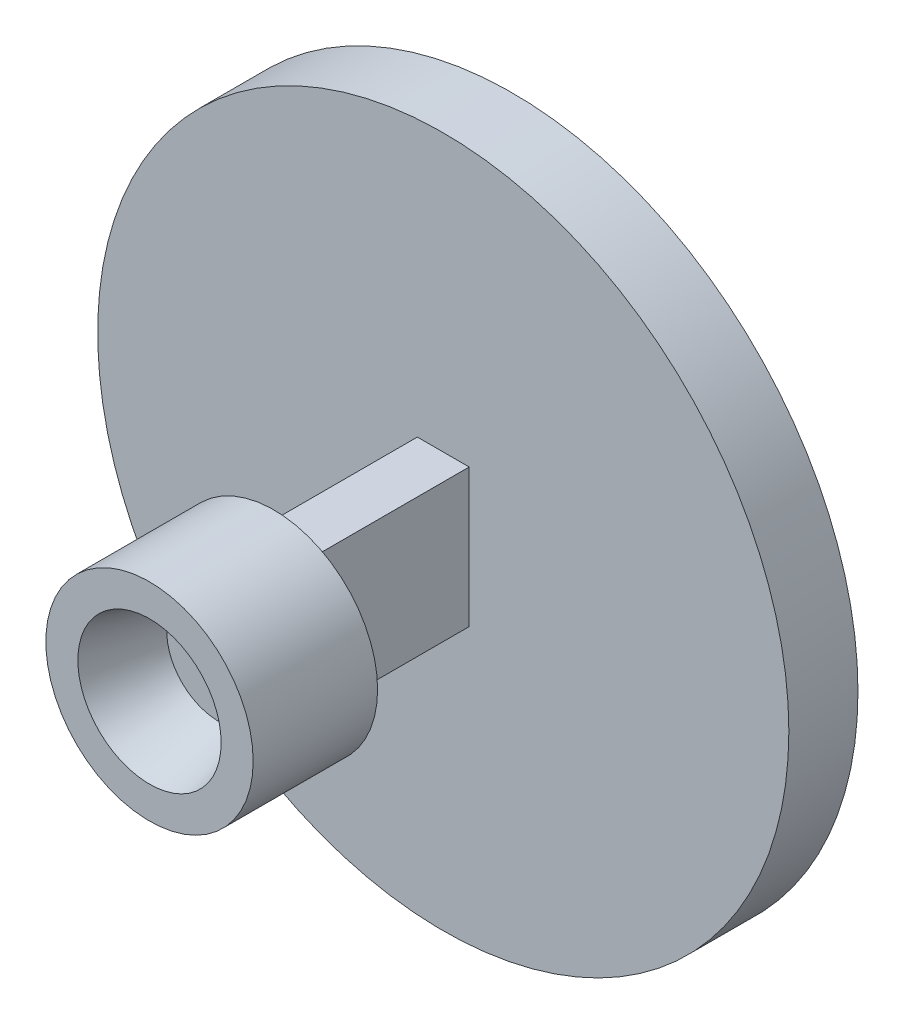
ISO-10303-21;
HEADER;
FILE_DESCRIPTION(('STEP AP214'),'2;1');
FILE_NAME('part.step','',(''),(''),'','','');
FILE_SCHEMA(('AUTOMOTIVE_DESIGN { 1 0 10303 214 1 1 1 1 }'));
ENDSEC;
DATA;
#1=APPLICATION_CONTEXT('core data for automotive mechanical design processes');
#2=APPLICATION_PROTOCOL_DEFINITION('international standard','automotive_design',2000,#1);
#3=PRODUCT_CONTEXT('',#1,'mechanical');
#4=PRODUCT('Part','Part','',(#3));
#5=PRODUCT_RELATED_PRODUCT_CATEGORY('part','',(#4));
#6=PRODUCT_DEFINITION_FORMATION('','',#4);
#7=PRODUCT_DEFINITION_CONTEXT('part definition',#1,'design');
#8=PRODUCT_DEFINITION('design','',#6,#7);
#9=PRODUCT_DEFINITION_SHAPE('','',#8);
#10=(LENGTH_UNIT() NAMED_UNIT(*) SI_UNIT(.MILLI.,.METRE.));
#11=(NAMED_UNIT(*) PLANE_ANGLE_UNIT() SI_UNIT($,.RADIAN.));
#12=(NAMED_UNIT(*) SI_UNIT($,.STERADIAN.) SOLID_ANGLE_UNIT());
#13=UNCERTAINTY_MEASURE_WITH_UNIT(LENGTH_MEASURE(1.E-05),#10,'distance_accuracy_value','');
#14=(GEOMETRIC_REPRESENTATION_CONTEXT(3) GLOBAL_UNCERTAINTY_ASSIGNED_CONTEXT((#13)) GLOBAL_UNIT_ASSIGNED_CONTEXT((#10,
#11,#12)) REPRESENTATION_CONTEXT('',''));
#15=CARTESIAN_POINT('',(0.,0.,0.));
#16=DIRECTION('',(0.,0.,1.));
#17=DIRECTION('',(1.,0.,0.));
#18=AXIS2_PLACEMENT_3D('',#15,#16,#17);
#19=CARTESIAN_POINT('',(0.75,2.,7.));
#20=DIRECTION('',(-1.,0.,0.));
#21=DIRECTION('',(0.,-1.,0.));
#22=AXIS2_PLACEMENT_3D('',#19,#20,#21);
#23=PLANE('',#22);
#24=DIRECTION('',(0.,1.,0.));
#25=VECTOR('',#24,1.);
#26=CARTESIAN_POINT('',(0.75,2.,6.9));
#27=LINE('',#26,#25);
#28=CARTESIAN_POINT('',(0.750000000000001,-2.,6.9));
#29=VERTEX_POINT('',#28);
#30=CARTESIAN_POINT('',(0.75,2.,6.9));
#31=VERTEX_POINT('',#30);
#32=EDGE_CURVE('E84',#29,#31,#27,.T.);
#33=ORIENTED_EDGE('',*,*,#32,.F.);
#34=DIRECTION('',(0.,0.,-1.));
#35=VECTOR('',#34,1.);
#36=CARTESIAN_POINT('',(0.75,-2.,7.));
#37=LINE('',#36,#35);
#38=CARTESIAN_POINT('',(0.75,-2.,2.));
#39=VERTEX_POINT('',#38);
#40=EDGE_CURVE('E75',#29,#39,#37,.T.);
#41=ORIENTED_EDGE('',*,*,#40,.T.);
#42=DIRECTION('',(0.,-1.,0.));
#43=VECTOR('',#42,1.);
#44=CARTESIAN_POINT('',(0.75,0.,2.));
#45=LINE('',#44,#43);
#46=CARTESIAN_POINT('',(0.75,2.,2.));
#47=VERTEX_POINT('',#46);
#48=EDGE_CURVE('E110',#47,#39,#45,.T.);
#49=ORIENTED_EDGE('',*,*,#48,.F.);
#50=DIRECTION('',(0.,0.,-1.));
#51=VECTOR('',#50,1.);
#52=CARTESIAN_POINT('',(0.75,2.,7.));
#53=LINE('',#52,#51);
#54=EDGE_CURVE('E87',#31,#47,#53,.T.);
#55=ORIENTED_EDGE('',*,*,#54,.F.);
#56=EDGE_LOOP('',(#33,#41,#49,#55));
#57=FACE_BOUND('',#56,.T.);
#58=ADVANCED_FACE('F33',(#57),#23,.F.);
#59=CARTESIAN_POINT('',(-0.75,2.,7.));
#60=DIRECTION('',(0.,-1.,0.));
#61=DIRECTION('',(0.,0.,-1.));
#62=AXIS2_PLACEMENT_3D('',#59,#60,#61);
#63=PLANE('',#62);
#64=DIRECTION('',(-1.,0.,0.));
#65=VECTOR('',#64,1.);
#66=CARTESIAN_POINT('',(-0.75,2.,6.9));
#67=LINE('',#66,#65);
#68=CARTESIAN_POINT('',(-0.75,2.,6.9));
#69=VERTEX_POINT('',#68);
#70=EDGE_CURVE('E49',#31,#69,#67,.T.);
#71=ORIENTED_EDGE('',*,*,#70,.F.);
#72=ORIENTED_EDGE('',*,*,#54,.T.);
#73=DIRECTION('',(1.,0.,0.));
#74=VECTOR('',#73,1.);
#75=CARTESIAN_POINT('',(0.,2.,2.));
#76=LINE('',#75,#74);
#77=CARTESIAN_POINT('',(-0.75,2.,2.));
#78=VERTEX_POINT('',#77);
#79=EDGE_CURVE('E107',#78,#47,#76,.T.);
#80=ORIENTED_EDGE('',*,*,#79,.F.);
#81=DIRECTION('',(0.,0.,-1.));
#82=VECTOR('',#81,1.);
#83=CARTESIAN_POINT('',(-0.75,2.,7.));
#84=LINE('',#83,#82);
#85=EDGE_CURVE('E100',#69,#78,#84,.T.);
#86=ORIENTED_EDGE('',*,*,#85,.F.);
#87=EDGE_LOOP('',(#71,#72,#80,#86));
#88=FACE_BOUND('',#87,.T.);
#89=ADVANCED_FACE('F132',(#88),#63,.F.);
#90=CARTESIAN_POINT('',(-0.75,2.,7.));
#91=DIRECTION('',(1.,0.,0.));
#92=DIRECTION('',(0.,1.,0.));
#93=AXIS2_PLACEMENT_3D('',#90,#91,#92);
#94=PLANE('',#93);
#95=DIRECTION('',(0.,-1.,0.));
#96=VECTOR('',#95,1.);
#97=CARTESIAN_POINT('',(-0.75,2.,6.9));
#98=LINE('',#97,#96);
#99=CARTESIAN_POINT('',(-0.75,-2.,6.9));
#100=VERTEX_POINT('',#99);
#101=EDGE_CURVE('E57',#69,#100,#98,.T.);
#102=ORIENTED_EDGE('',*,*,#101,.F.);
#103=ORIENTED_EDGE('',*,*,#85,.T.);
#104=DIRECTION('',(0.,1.,0.));
#105=VECTOR('',#104,1.);
#106=CARTESIAN_POINT('',(-0.75,0.,2.));
#107=LINE('',#106,#105);
#108=CARTESIAN_POINT('',(-0.75,-2.,2.));
#109=VERTEX_POINT('',#108);
#110=EDGE_CURVE('E104',#109,#78,#107,.T.);
#111=ORIENTED_EDGE('',*,*,#110,.F.);
#112=DIRECTION('',(0.,0.,-1.));
#113=VECTOR('',#112,1.);
#114=CARTESIAN_POINT('',(-0.75,-2.,7.));
#115=LINE('',#114,#113);
#116=EDGE_CURVE('E83',#100,#109,#115,.T.);
#117=ORIENTED_EDGE('',*,*,#116,.F.);
#118=EDGE_LOOP('',(#102,#103,#111,#117));
#119=FACE_BOUND('',#118,.T.);
#120=ADVANCED_FACE('F137',(#119),#94,.F.);
#121=CARTESIAN_POINT('',(-0.75,-2.,7.));
#122=DIRECTION('',(0.,1.,0.));
#123=DIRECTION('',(0.,0.,1.));
#124=AXIS2_PLACEMENT_3D('',#121,#122,#123);
#125=PLANE('',#124);
#126=DIRECTION('',(1.,0.,0.));
#127=VECTOR('',#126,1.);
#128=CARTESIAN_POINT('',(-0.75,-2.,6.9));
#129=LINE('',#128,#127);
#130=EDGE_CURVE('E11',#100,#29,#129,.T.);
#131=ORIENTED_EDGE('',*,*,#130,.F.);
#132=ORIENTED_EDGE('',*,*,#116,.T.);
#133=DIRECTION('',(-1.,0.,0.));
#134=VECTOR('',#133,1.);
#135=CARTESIAN_POINT('',(0.,-2.,2.));
#136=LINE('',#135,#134);
#137=EDGE_CURVE('E79',#39,#109,#136,.T.);
#138=ORIENTED_EDGE('',*,*,#137,.F.);
#139=ORIENTED_EDGE('',*,*,#40,.F.);
#140=EDGE_LOOP('',(#131,#132,#138,#139));
#141=FACE_BOUND('',#140,.T.);
#142=ADVANCED_FACE('F77',(#141),#125,.F.);
#143=CARTESIAN_POINT('',(0.,0.,2.));
#144=DIRECTION('',(0.,0.,1.));
#145=DIRECTION('',(1.,0.,0.));
#146=AXIS2_PLACEMENT_3D('',#143,#144,#145);
#147=PLANE('',#146);
#148=CARTESIAN_POINT('',(0.,0.,2.));
#149=DIRECTION('',(0.,0.,1.));
#150=DIRECTION('',(1.,0.,0.));
#151=AXIS2_PLACEMENT_3D('',#148,#149,#150);
#152=CIRCLE('',#151,10.);
#153=CARTESIAN_POINT('',(10.,0.,2.));
#154=VERTEX_POINT('',#153);
#155=EDGE_CURVE('E42',#154,#154,#152,.T.);
#156=ORIENTED_EDGE('',*,*,#155,.T.);
#157=EDGE_LOOP('',(#156));
#158=FACE_BOUND('',#157,.T.);
#159=ORIENTED_EDGE('',*,*,#79,.T.);
#160=ORIENTED_EDGE('',*,*,#48,.T.);
#161=ORIENTED_EDGE('',*,*,#137,.T.);
#162=ORIENTED_EDGE('',*,*,#110,.T.);
#163=EDGE_LOOP('',(#159,#160,#161,#162));
#164=FACE_BOUND('',#163,.T.);
#165=ADVANCED_FACE('F128',(#158,#164),#147,.T.);
#166=CARTESIAN_POINT('',(0.,0.,2.));
#167=DIRECTION('',(0.,0.,-1.));
#168=DIRECTION('',(-1.,0.,0.));
#169=AXIS2_PLACEMENT_3D('',#166,#167,#168);
#170=CYLINDRICAL_SURFACE('',#169,10.);
#171=ORIENTED_EDGE('',*,*,#155,.F.);
#172=EDGE_LOOP('',(#171));
#173=FACE_BOUND('',#172,.T.);
#174=CARTESIAN_POINT('',(0.,0.,0.));
#175=DIRECTION('',(0.,0.,1.));
#176=DIRECTION('',(1.,0.,0.));
#177=AXIS2_PLACEMENT_3D('',#174,#175,#176);
#178=CIRCLE('',#177,10.);
#179=CARTESIAN_POINT('',(10.,0.,0.));
#180=VERTEX_POINT('',#179);
#181=EDGE_CURVE('E112',#180,#180,#178,.T.);
#182=ORIENTED_EDGE('',*,*,#181,.T.);
#183=EDGE_LOOP('',(#182));
#184=FACE_BOUND('',#183,.T.);
#185=ADVANCED_FACE('F35',(#173,#184),#170,.T.);
#186=CARTESIAN_POINT('',(0.,0.,0.));
#187=DIRECTION('',(0.,0.,1.));
#188=DIRECTION('',(1.,0.,0.));
#189=AXIS2_PLACEMENT_3D('',#186,#187,#188);
#190=PLANE('',#189);
#191=ORIENTED_EDGE('',*,*,#181,.F.);
#192=EDGE_LOOP('',(#191));
#193=FACE_BOUND('',#192,.T.);
#194=ADVANCED_FACE('F119',(#193),#190,.F.);
#195=CARTESIAN_POINT('',(0.,0.,6.9));
#196=DIRECTION('',(0.,0.,1.));
#197=DIRECTION('',(1.,0.,0.));
#198=AXIS2_PLACEMENT_3D('',#195,#196,#197);
#199=PLANE('',#198);
#200=CARTESIAN_POINT('',(0.,0.,6.9));
#201=DIRECTION('',(0.,0.,1.));
#202=DIRECTION('',(1.,0.,0.));
#203=AXIS2_PLACEMENT_3D('',#200,#201,#202);
#204=CIRCLE('',#203,3.);
#205=CARTESIAN_POINT('',(3.,0.,6.9));
#206=VERTEX_POINT('',#205);
#207=EDGE_CURVE('E91',#206,#206,#204,.T.);
#208=ORIENTED_EDGE('',*,*,#207,.F.);
#209=EDGE_LOOP('',(#208));
#210=FACE_BOUND('',#209,.T.);
#211=ORIENTED_EDGE('',*,*,#130,.T.);
#212=ORIENTED_EDGE('',*,*,#32,.T.);
#213=ORIENTED_EDGE('',*,*,#70,.T.);
#214=ORIENTED_EDGE('',*,*,#101,.T.);
#215=EDGE_LOOP('',(#211,#212,#213,#214));
#216=FACE_BOUND('',#215,.T.);
#217=ADVANCED_FACE('F90',(#210,#216),#199,.F.);
#218=CARTESIAN_POINT('',(0.,0.,6.9));
#219=DIRECTION('',(0.,0.,1.));
#220=DIRECTION('',(1.,0.,0.));
#221=AXIS2_PLACEMENT_3D('',#218,#219,#220);
#222=CYLINDRICAL_SURFACE('',#221,3.);
#223=ORIENTED_EDGE('',*,*,#207,.T.);
#224=EDGE_LOOP('',(#223));
#225=FACE_BOUND('',#224,.T.);
#226=CARTESIAN_POINT('',(0.,0.,10.5));
#227=DIRECTION('',(0.,0.,1.));
#228=DIRECTION('',(1.,0.,0.));
#229=AXIS2_PLACEMENT_3D('',#226,#227,#228);
#230=CIRCLE('',#229,3.);
#231=CARTESIAN_POINT('',(3.,0.,10.5));
#232=VERTEX_POINT('',#231);
#233=EDGE_CURVE('E95',#232,#232,#230,.T.);
#234=ORIENTED_EDGE('',*,*,#233,.F.);
#235=EDGE_LOOP('',(#234));
#236=FACE_BOUND('',#235,.T.);
#237=ADVANCED_FACE('F125',(#225,#236),#222,.T.);
#238=CARTESIAN_POINT('',(0.,0.,10.5));
#239=DIRECTION('',(0.,0.,1.));
#240=DIRECTION('',(1.,0.,0.));
#241=AXIS2_PLACEMENT_3D('',#238,#239,#240);
#242=PLANE('',#241);
#243=CARTESIAN_POINT('',(0.,0.,10.5));
#244=DIRECTION('',(0.,0.,1.));
#245=DIRECTION('',(1.,0.,0.));
#246=AXIS2_PLACEMENT_3D('',#243,#244,#245);
#247=CIRCLE('',#246,2.07349077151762);
#248=CARTESIAN_POINT('',(2.07349077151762,0.,10.5));
#249=VERTEX_POINT('',#248);
#250=EDGE_CURVE('E37',#249,#249,#247,.F.);
#251=ORIENTED_EDGE('',*,*,#250,.T.);
#252=EDGE_LOOP('',(#251));
#253=FACE_BOUND('',#252,.T.);
#254=ORIENTED_EDGE('',*,*,#233,.T.);
#255=EDGE_LOOP('',(#254));
#256=FACE_BOUND('',#255,.T.);
#257=ADVANCED_FACE('F155',(#253,#256),#242,.T.);
#258=CARTESIAN_POINT('',(0.,0.,8.5));
#259=DIRECTION('',(0.,0.,1.));
#260=DIRECTION('',(1.,0.,0.));
#261=AXIS2_PLACEMENT_3D('',#258,#259,#260);
#262=CONICAL_SURFACE('',#261,1.5,0.279252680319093);
#263=ORIENTED_EDGE('',*,*,#250,.F.);
#264=EDGE_LOOP('',(#263));
#265=FACE_BOUND('',#264,.T.);
#266=CARTESIAN_POINT('',(0.,0.,8.5));
#267=DIRECTION('',(0.,0.,1.));
#268=DIRECTION('',(1.,0.,0.));
#269=AXIS2_PLACEMENT_3D('',#266,#267,#268);
#270=CIRCLE('',#269,1.5);
#271=CARTESIAN_POINT('',(1.5,0.,8.5));
#272=VERTEX_POINT('',#271);
#273=EDGE_CURVE('E172',#272,#272,#270,.T.);
#274=ORIENTED_EDGE('',*,*,#273,.F.);
#275=EDGE_LOOP('',(#274));
#276=FACE_BOUND('',#275,.T.);
#277=ADVANCED_FACE('F160',(#265,#276),#262,.F.);
#278=CARTESIAN_POINT('',(0.,0.,8.5));
#279=DIRECTION('',(0.,0.,1.));
#280=DIRECTION('',(1.,0.,0.));
#281=AXIS2_PLACEMENT_3D('',#278,#279,#280);
#282=PLANE('',#281);
#283=ORIENTED_EDGE('',*,*,#273,.T.);
#284=EDGE_LOOP('',(#283));
#285=FACE_BOUND('',#284,.T.);
#286=ADVANCED_FACE('F164',(#285),#282,.T.);
#287=CLOSED_SHELL('',(#58,#89,#120,#142,#165,#185,#194,#217,#237,#257,#277,#286));
#288=MANIFOLD_SOLID_BREP('B2',#287);
#289=ADVANCED_BREP_SHAPE_REPRESENTATION('',(#18,#288),#14);
#290=SHAPE_DEFINITION_REPRESENTATION(#9,#289);
ENDSEC;
END-ISO-10303-21;
